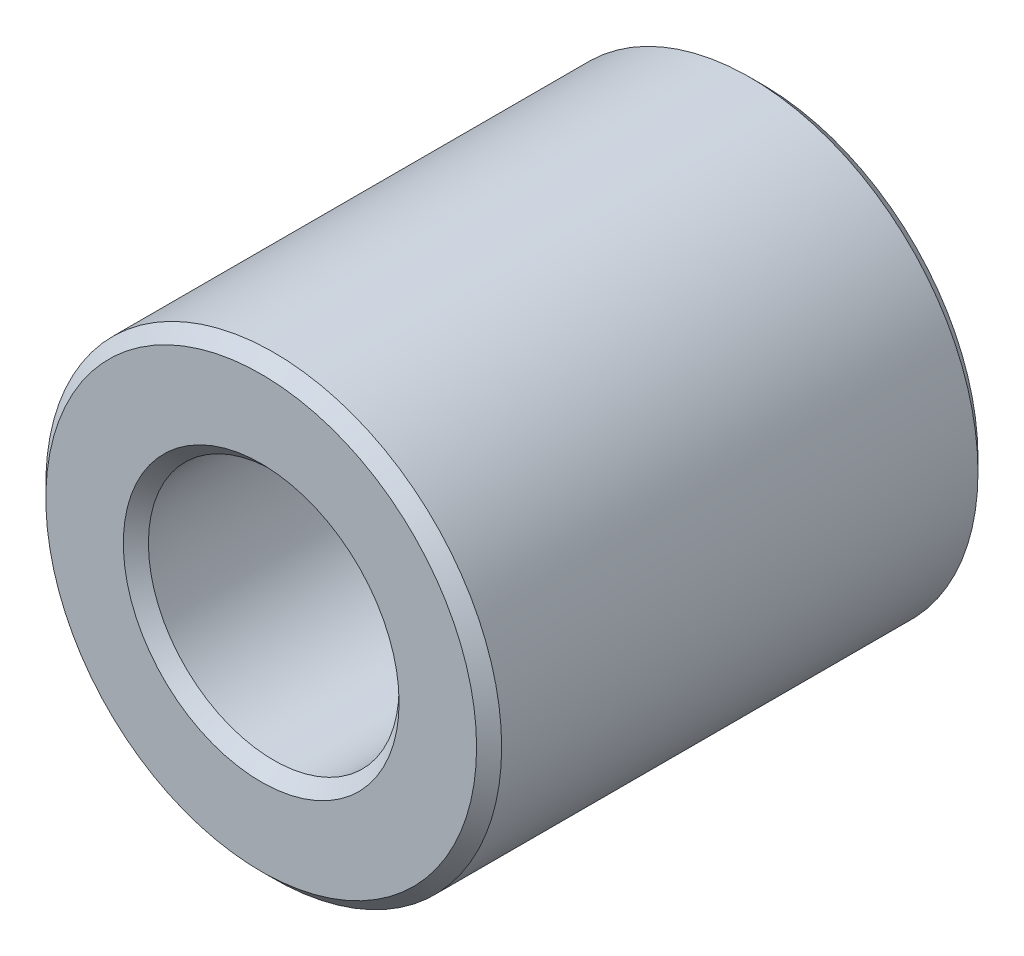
ISO-10303-21;
HEADER;
FILE_DESCRIPTION(('STEP AP214'),'2;1');
FILE_NAME('part.step','',(''),(''),'','','');
FILE_SCHEMA(('AUTOMOTIVE_DESIGN { 1 0 10303 214 1 1 1 1 }'));
ENDSEC;
DATA;
#1=APPLICATION_CONTEXT('core data for automotive mechanical design processes');
#2=APPLICATION_PROTOCOL_DEFINITION('international standard','automotive_design',2000,#1);
#3=PRODUCT_CONTEXT('',#1,'mechanical');
#4=PRODUCT('Part','Part','',(#3));
#5=PRODUCT_RELATED_PRODUCT_CATEGORY('part','',(#4));
#6=PRODUCT_DEFINITION_FORMATION('','',#4);
#7=PRODUCT_DEFINITION_CONTEXT('part definition',#1,'design');
#8=PRODUCT_DEFINITION('design','',#6,#7);
#9=PRODUCT_DEFINITION_SHAPE('','',#8);
#10=(LENGTH_UNIT() NAMED_UNIT(*) SI_UNIT(.MILLI.,.METRE.));
#11=(NAMED_UNIT(*) PLANE_ANGLE_UNIT() SI_UNIT($,.RADIAN.));
#12=(NAMED_UNIT(*) SI_UNIT($,.STERADIAN.) SOLID_ANGLE_UNIT());
#13=UNCERTAINTY_MEASURE_WITH_UNIT(LENGTH_MEASURE(1.E-05),#10,'distance_accuracy_value','');
#14=(GEOMETRIC_REPRESENTATION_CONTEXT(3) GLOBAL_UNCERTAINTY_ASSIGNED_CONTEXT((#13)) GLOBAL_UNIT_ASSIGNED_CONTEXT((#10,
#11,#12)) REPRESENTATION_CONTEXT('',''));
#15=CARTESIAN_POINT('',(0.,0.,0.));
#16=DIRECTION('',(0.,0.,1.));
#17=DIRECTION('',(1.,0.,0.));
#18=AXIS2_PLACEMENT_3D('',#15,#16,#17);
#19=CARTESIAN_POINT('',(0.,0.,44.));
#20=DIRECTION('',(0.,0.,1.));
#21=DIRECTION('',(1.,0.,0.));
#22=AXIS2_PLACEMENT_3D('',#19,#20,#21);
#23=PLANE('',#22);
#24=CARTESIAN_POINT('',(0.,0.,44.));
#25=DIRECTION('',(0.,0.,1.));
#26=DIRECTION('',(1.,0.,0.));
#27=AXIS2_PLACEMENT_3D('',#24,#25,#26);
#28=CIRCLE('',#27,24.2);
#29=CARTESIAN_POINT('',(24.2,0.,44.));
#30=VERTEX_POINT('',#29);
#31=EDGE_CURVE('E10',#30,#30,#28,.F.);
#32=ORIENTED_EDGE('',*,*,#31,.T.);
#33=EDGE_LOOP('',(#32));
#34=FACE_BOUND('',#33,.T.);
#35=CARTESIAN_POINT('',(0.,0.,44.));
#36=DIRECTION('',(0.,0.,1.));
#37=DIRECTION('',(1.,0.,0.));
#38=AXIS2_PLACEMENT_3D('',#35,#36,#37);
#39=CIRCLE('',#38,37.8);
#40=CARTESIAN_POINT('',(37.8,0.,44.));
#41=VERTEX_POINT('',#40);
#42=EDGE_CURVE('E45',#41,#41,#39,.T.);
#43=ORIENTED_EDGE('',*,*,#42,.T.);
#44=EDGE_LOOP('',(#43));
#45=FACE_BOUND('',#44,.T.);
#46=ADVANCED_FACE('F37',(#34,#45),#23,.T.);
#47=CARTESIAN_POINT('',(0.,0.,-44.));
#48=DIRECTION('',(0.,0.,1.));
#49=DIRECTION('',(1.,0.,0.));
#50=AXIS2_PLACEMENT_3D('',#47,#48,#49);
#51=PLANE('',#50);
#52=CARTESIAN_POINT('',(0.,0.,-44.));
#53=DIRECTION('',(0.,0.,1.));
#54=DIRECTION('',(1.,0.,0.));
#55=AXIS2_PLACEMENT_3D('',#52,#53,#54);
#56=CIRCLE('',#55,24.2);
#57=CARTESIAN_POINT('',(24.2,0.,-44.));
#58=VERTEX_POINT('',#57);
#59=EDGE_CURVE('E71',#58,#58,#56,.T.);
#60=ORIENTED_EDGE('',*,*,#59,.T.);
#61=EDGE_LOOP('',(#60));
#62=FACE_BOUND('',#61,.T.);
#63=CARTESIAN_POINT('',(0.,0.,-44.));
#64=DIRECTION('',(0.,0.,1.));
#65=DIRECTION('',(1.,0.,0.));
#66=AXIS2_PLACEMENT_3D('',#63,#64,#65);
#67=CIRCLE('',#66,37.8);
#68=CARTESIAN_POINT('',(37.8,0.,-44.));
#69=VERTEX_POINT('',#68);
#70=EDGE_CURVE('E74',#69,#69,#67,.F.);
#71=ORIENTED_EDGE('',*,*,#70,.T.);
#72=EDGE_LOOP('',(#71));
#73=FACE_BOUND('',#72,.T.);
#74=ADVANCED_FACE('F78',(#62,#73),#51,.F.);
#75=CARTESIAN_POINT('',(0.,0.,44.));
#76=DIRECTION('',(0.,0.,-1.));
#77=DIRECTION('',(-1.,0.,0.));
#78=AXIS2_PLACEMENT_3D('',#75,#76,#77);
#79=CYLINDRICAL_SURFACE('',#78,40.);
#80=CARTESIAN_POINT('',(0.,0.,-41.8));
#81=DIRECTION('',(0.,0.,1.));
#82=DIRECTION('',(1.,0.,0.));
#83=AXIS2_PLACEMENT_3D('',#80,#81,#82);
#84=CIRCLE('',#83,40.);
#85=CARTESIAN_POINT('',(40.,0.,-41.8));
#86=VERTEX_POINT('',#85);
#87=EDGE_CURVE('E51',#86,#86,#84,.T.);
#88=ORIENTED_EDGE('',*,*,#87,.T.);
#89=EDGE_LOOP('',(#88));
#90=FACE_BOUND('',#89,.T.);
#91=CARTESIAN_POINT('',(0.,0.,41.8));
#92=DIRECTION('',(0.,0.,1.));
#93=DIRECTION('',(1.,0.,0.));
#94=AXIS2_PLACEMENT_3D('',#91,#92,#93);
#95=CIRCLE('',#94,40.);
#96=CARTESIAN_POINT('',(40.,0.,41.8));
#97=VERTEX_POINT('',#96);
#98=EDGE_CURVE('E58',#97,#97,#95,.F.);
#99=ORIENTED_EDGE('',*,*,#98,.T.);
#100=EDGE_LOOP('',(#99));
#101=FACE_BOUND('',#100,.T.);
#102=ADVANCED_FACE('F88',(#90,#101),#79,.T.);
#103=CARTESIAN_POINT('',(0.,0.,44.));
#104=DIRECTION('',(0.,0.,-1.));
#105=DIRECTION('',(-1.,0.,0.));
#106=AXIS2_PLACEMENT_3D('',#103,#104,#105);
#107=CYLINDRICAL_SURFACE('',#106,22.);
#108=CARTESIAN_POINT('',(0.,0.,-41.8));
#109=DIRECTION('',(0.,0.,1.));
#110=DIRECTION('',(1.,0.,0.));
#111=AXIS2_PLACEMENT_3D('',#108,#109,#110);
#112=CIRCLE('',#111,22.);
#113=CARTESIAN_POINT('',(22.,0.,-41.8));
#114=VERTEX_POINT('',#113);
#115=EDGE_CURVE('E64',#114,#114,#112,.F.);
#116=ORIENTED_EDGE('',*,*,#115,.T.);
#117=EDGE_LOOP('',(#116));
#118=FACE_BOUND('',#117,.T.);
#119=CARTESIAN_POINT('',(0.,0.,41.8));
#120=DIRECTION('',(0.,0.,1.));
#121=DIRECTION('',(1.,0.,0.));
#122=AXIS2_PLACEMENT_3D('',#119,#120,#121);
#123=CIRCLE('',#122,22.);
#124=CARTESIAN_POINT('',(22.,0.,41.8));
#125=VERTEX_POINT('',#124);
#126=EDGE_CURVE('E67',#125,#125,#123,.T.);
#127=ORIENTED_EDGE('',*,*,#126,.T.);
#128=EDGE_LOOP('',(#127));
#129=FACE_BOUND('',#128,.T.);
#130=ADVANCED_FACE('F91',(#118,#129),#107,.F.);
#131=CARTESIAN_POINT('',(0.,0.,-44.));
#132=DIRECTION('',(0.,0.,-1.));
#133=DIRECTION('',(-1.,0.,0.));
#134=AXIS2_PLACEMENT_3D('',#131,#132,#133);
#135=CONICAL_SURFACE('',#134,24.2,0.785398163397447);
#136=ORIENTED_EDGE('',*,*,#115,.F.);
#137=EDGE_LOOP('',(#136));
#138=FACE_BOUND('',#137,.T.);
#139=ORIENTED_EDGE('',*,*,#59,.F.);
#140=EDGE_LOOP('',(#139));
#141=FACE_BOUND('',#140,.T.);
#142=ADVANCED_FACE('F84',(#138,#141),#135,.F.);
#143=CARTESIAN_POINT('',(0.,0.,-41.8));
#144=DIRECTION('',(0.,0.,1.));
#145=DIRECTION('',(1.,0.,0.));
#146=AXIS2_PLACEMENT_3D('',#143,#144,#145);
#147=CONICAL_SURFACE('',#146,40.,0.785398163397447);
#148=CARTESIAN_POINT('',(37.8,0.,-44.));
#149=CARTESIAN_POINT('',(37.8229166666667,0.,-43.9770833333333));
#150=CARTESIAN_POINT('',(37.8458333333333,0.,-43.9541666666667));
#151=CARTESIAN_POINT('',(37.8916666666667,0.,-43.9083333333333));
#152=CARTESIAN_POINT('',(37.9145833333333,0.,-43.8854166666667));
#153=CARTESIAN_POINT('',(37.9604166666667,0.,-43.8395833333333));
#154=CARTESIAN_POINT('',(37.9833333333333,0.,-43.8166666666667));
#155=CARTESIAN_POINT('',(38.0291666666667,0.,-43.7708333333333));
#156=CARTESIAN_POINT('',(38.0520833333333,0.,-43.7479166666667));
#157=CARTESIAN_POINT('',(38.0979166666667,0.,-43.7020833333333));
#158=CARTESIAN_POINT('',(38.1208333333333,0.,-43.6791666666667));
#159=CARTESIAN_POINT('',(38.1666666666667,0.,-43.6333333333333));
#160=CARTESIAN_POINT('',(38.1895833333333,0.,-43.6104166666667));
#161=CARTESIAN_POINT('',(38.2354166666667,0.,-43.5645833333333));
#162=CARTESIAN_POINT('',(38.2583333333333,0.,-43.5416666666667));
#163=CARTESIAN_POINT('',(38.3041666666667,0.,-43.4958333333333));
#164=CARTESIAN_POINT('',(38.3270833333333,0.,-43.4729166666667));
#165=CARTESIAN_POINT('',(38.3729166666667,0.,-43.4270833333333));
#166=CARTESIAN_POINT('',(38.3958333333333,0.,-43.4041666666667));
#167=CARTESIAN_POINT('',(38.4416666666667,0.,-43.3583333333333));
#168=CARTESIAN_POINT('',(38.4645833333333,0.,-43.3354166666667));
#169=CARTESIAN_POINT('',(38.5104166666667,0.,-43.2895833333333));
#170=CARTESIAN_POINT('',(38.5333333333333,0.,-43.2666666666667));
#171=CARTESIAN_POINT('',(38.5791666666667,0.,-43.2208333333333));
#172=CARTESIAN_POINT('',(38.6020833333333,0.,-43.1979166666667));
#173=CARTESIAN_POINT('',(38.6479166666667,0.,-43.1520833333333));
#174=CARTESIAN_POINT('',(38.6708333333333,0.,-43.1291666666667));
#175=CARTESIAN_POINT('',(38.7166666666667,0.,-43.0833333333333));
#176=CARTESIAN_POINT('',(38.7395833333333,0.,-43.0604166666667));
#177=CARTESIAN_POINT('',(38.7854166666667,0.,-43.0145833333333));
#178=CARTESIAN_POINT('',(38.8083333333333,0.,-42.9916666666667));
#179=CARTESIAN_POINT('',(38.8541666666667,0.,-42.9458333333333));
#180=CARTESIAN_POINT('',(38.8770833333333,0.,-42.9229166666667));
#181=CARTESIAN_POINT('',(38.9229166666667,0.,-42.8770833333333));
#182=CARTESIAN_POINT('',(38.9458333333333,0.,-42.8541666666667));
#183=CARTESIAN_POINT('',(38.9916666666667,0.,-42.8083333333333));
#184=CARTESIAN_POINT('',(39.0145833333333,0.,-42.7854166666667));
#185=CARTESIAN_POINT('',(39.0604166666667,0.,-42.7395833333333));
#186=CARTESIAN_POINT('',(39.0833333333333,0.,-42.7166666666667));
#187=CARTESIAN_POINT('',(39.1291666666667,0.,-42.6708333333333));
#188=CARTESIAN_POINT('',(39.1520833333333,0.,-42.6479166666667));
#189=CARTESIAN_POINT('',(39.1979166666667,0.,-42.6020833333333));
#190=CARTESIAN_POINT('',(39.2208333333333,0.,-42.5791666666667));
#191=CARTESIAN_POINT('',(39.2666666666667,0.,-42.5333333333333));
#192=CARTESIAN_POINT('',(39.2895833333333,0.,-42.5104166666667));
#193=CARTESIAN_POINT('',(39.3354166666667,0.,-42.4645833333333));
#194=CARTESIAN_POINT('',(39.3583333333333,0.,-42.4416666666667));
#195=CARTESIAN_POINT('',(39.4041666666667,0.,-42.3958333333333));
#196=CARTESIAN_POINT('',(39.4270833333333,0.,-42.3729166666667));
#197=CARTESIAN_POINT('',(39.4729166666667,0.,-42.3270833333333));
#198=CARTESIAN_POINT('',(39.4958333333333,0.,-42.3041666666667));
#199=CARTESIAN_POINT('',(39.5416666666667,0.,-42.2583333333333));
#200=CARTESIAN_POINT('',(39.5645833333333,0.,-42.2354166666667));
#201=CARTESIAN_POINT('',(39.6104166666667,0.,-42.1895833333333));
#202=CARTESIAN_POINT('',(39.6333333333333,0.,-42.1666666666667));
#203=CARTESIAN_POINT('',(39.6791666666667,0.,-42.1208333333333));
#204=CARTESIAN_POINT('',(39.7020833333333,0.,-42.0979166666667));
#205=CARTESIAN_POINT('',(39.7479166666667,0.,-42.0520833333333));
#206=CARTESIAN_POINT('',(39.7708333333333,0.,-42.0291666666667));
#207=CARTESIAN_POINT('',(39.8166666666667,0.,-41.9833333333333));
#208=CARTESIAN_POINT('',(39.8395833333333,0.,-41.9604166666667));
#209=CARTESIAN_POINT('',(39.8854166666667,0.,-41.9145833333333));
#210=CARTESIAN_POINT('',(39.9083333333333,0.,-41.8916666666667));
#211=CARTESIAN_POINT('',(39.9541666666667,0.,-41.8458333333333));
#212=CARTESIAN_POINT('',(39.9770833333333,0.,-41.8229166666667));
#213=CARTESIAN_POINT('',(40.,0.,-41.8));
#214=B_SPLINE_CURVE_WITH_KNOTS('',3,(#148,#149,#150,#151,#152,#153,#154,#155,#156,#157,#158,
#159,#160,#161,#162,#163,#164,#165,#166,#167,#168,#169,#170,#171,#172,#173,#174,#175,#176,#177,
#178,#179,#180,#181,#182,#183,#184,#185,#186,#187,#188,#189,#190,#191,#192,#193,#194,#195,#196,
#197,#198,#199,#200,#201,#202,#203,#204,#205,#206,#207,#208,#209,#210,#211,#212,#213),
.UNSPECIFIED.,.F.,.F.,(4,2,2,2,2,2,2,2,2,2,2,2,2,2,2,2,2,2,2,2,2,2,2,2,2,2,2,2,2,2,2,2,4),(0.,
0.0972271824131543,0.194454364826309,0.291681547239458,0.388908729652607,0.486135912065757,
0.583363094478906,0.680590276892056,0.777817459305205,0.875044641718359,0.972271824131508,
1.06949900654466,1.16672618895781,1.26395337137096,1.36118055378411,1.45840773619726,
1.55563491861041,1.65286210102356,1.75008928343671,1.84731646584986,1.94454364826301,
2.04177083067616,2.13899801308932,2.23622519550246,2.33345237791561,2.43067956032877,
2.52790674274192,2.62513392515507,2.72236110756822,2.81958828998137,2.91681547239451,
3.01404265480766,3.11126983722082),.UNSPECIFIED.);
#215=EDGE_CURVE('BSEAM80',#69,#86,#214,.T.);
#216=ORIENTED_EDGE('',*,*,#70,.F.);
#217=ORIENTED_EDGE('',*,*,#87,.F.);
#218=ORIENTED_EDGE('',*,*,#215,.T.);
#219=ORIENTED_EDGE('',*,*,#215,.F.);
#220=EDGE_LOOP('',(#216,#218,#217,#219));
#221=FACE_BOUND('',#220,.T.);
#222=ADVANCED_FACE('F80',(#221),#147,.T.);
#223=CARTESIAN_POINT('',(0.,0.,41.8));
#224=DIRECTION('',(0.,0.,1.));
#225=DIRECTION('',(1.,0.,0.));
#226=AXIS2_PLACEMENT_3D('',#223,#224,#225);
#227=CONICAL_SURFACE('',#226,22.,0.785398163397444);
#228=ORIENTED_EDGE('',*,*,#31,.F.);
#229=EDGE_LOOP('',(#228));
#230=FACE_BOUND('',#229,.T.);
#231=ORIENTED_EDGE('',*,*,#126,.F.);
#232=EDGE_LOOP('',(#231));
#233=FACE_BOUND('',#232,.T.);
#234=ADVANCED_FACE('F83',(#230,#233),#227,.F.);
#235=CARTESIAN_POINT('',(0.,0.,44.));
#236=DIRECTION('',(0.,0.,-1.));
#237=DIRECTION('',(-1.,0.,0.));
#238=AXIS2_PLACEMENT_3D('',#235,#236,#237);
#239=CONICAL_SURFACE('',#238,37.8,0.785398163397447);
#240=ORIENTED_EDGE('',*,*,#98,.F.);
#241=EDGE_LOOP('',(#240));
#242=FACE_BOUND('',#241,.T.);
#243=ORIENTED_EDGE('',*,*,#42,.F.);
#244=EDGE_LOOP('',(#243));
#245=FACE_BOUND('',#244,.T.);
#246=ADVANCED_FACE('F39',(#242,#245),#239,.T.);
#247=CLOSED_SHELL('',(#46,#74,#102,#130,#142,#222,#234,#246));
#248=MANIFOLD_SOLID_BREP('B2',#247);
#249=ADVANCED_BREP_SHAPE_REPRESENTATION('',(#18,#248),#14);
#250=SHAPE_DEFINITION_REPRESENTATION(#9,#249);
ENDSEC;
END-ISO-10303-21;
